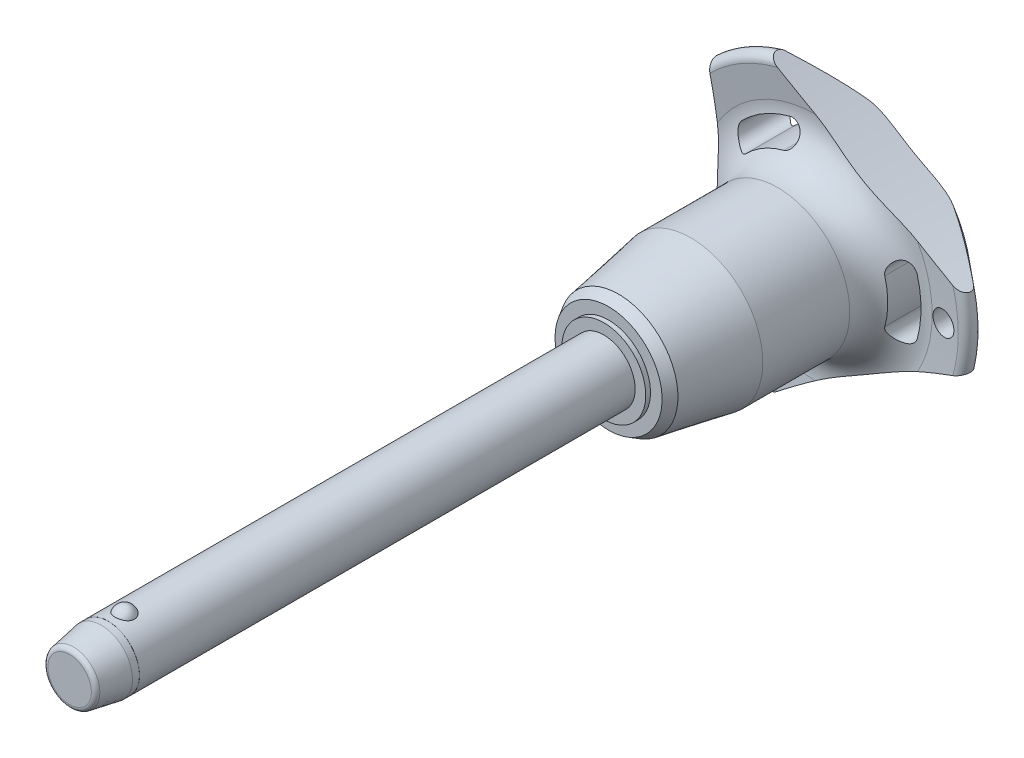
from build123d import *

# Parameters (mm, degrees)
SKETCH1_R           = 4
BOSS_EXTRUDE1_DEPTH = 60
SKETCH2_R           = 3.4
BOSS_EXTRUDE2_DEPTH = 33.3
BOSS_EXTRUDE3_START = 8.2
SKETCH1_2_R         = 4
BOSS_EXTRUDE3_DEPTH = 8.2
CHAMFER1_SIZE       = 4.1
CHAMFER1_SIZE2      = 0.722940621
FILLET1_R           = 0.6
SKETCH6_R           = 102.8
CUT_EXTRUDE1_DEPTH  = 98.333870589
CIRPATTERN1_COUNT   = 3
SKETCH7_R           = 1.5
CUT_EXTRUDE2_DEPTH  = 98.167560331
SKETCH8_R           = 4
SKETCH8_R_2         = 3.99
CUT_EXTRUDE3_DEPTH  = 4.92


with BuildPart() as part:
    # Sketch1 → Boss-Extrude1 (new body)
    with BuildSketch(Plane.XY):
        Circle(SKETCH1_R)
    extrude(amount=-BOSS_EXTRUDE1_DEPTH)

    # Sketch2 → Boss-Extrude2 (add)
    with BuildSketch(Plane(origin=(0, 0, -60), x_dir=(-1, 0, 0), z_dir=(0, 0, -1))):
        Circle(SKETCH2_R)
    extrude(amount=BOSS_EXTRUDE2_DEPTH)

    # Sketch3 → Revolve1 (revolve)
    with BuildSketch(Plane(origin=(0, 0, 0), x_dir=(0, 0, -1), z_dir=(1, 0, 0))):
        with BuildLine():
            Line((-1.2, 4.8), (-1.2, 2.2))
            ThreePointArc((-1.2, 2.2), (0.1, 3.5), (-1.2, 4.8))
        make_face()
        with BuildLine():
            Line((-1.2, -2.2), (-1.2, -4.8))
            ThreePointArc((-1.2, -4.8), (0.1, -3.5), (-1.2, -2.2))
        make_face()
    revolve(axis=Axis((0, -2.2, 1.2), (0, 1, 0)))

    # Sketch1_2 → Boss-Extrude3 (add)
    with BuildSketch(Plane.XY.offset(BOSS_EXTRUDE3_START)):
        Circle(SKETCH1_2_R)
    extrude(amount=-BOSS_EXTRUDE3_DEPTH)

    # Chamfer1
    chamfer1_edges = [part.edges().sort_by_distance(p)[0] for p in [
        (-4, 0, 8.2),
    ]]
    chamfer1_side = [part.faces().sort_by_distance(p)[0] for p in [
        (-4, 0, -25.9),
    ]]
    chamfer(chamfer1_edges, length=CHAMFER1_SIZE, length2=CHAMFER1_SIZE2, reference=chamfer1_side[0])

    # Fillet1
    fillet1_edges = [part.edges().sort_by_distance(p)[0] for p in [
        (-3.277059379, 0, 8.2),
        (3.4, 0, -93.3),
    ]]
    fillet(fillet1_edges, radius=FILLET1_R)

    # Sketch4 → Revolve2 (revolve)
    with BuildSketch(Plane(origin=(0, 0, 0), x_dir=(0, 0, -1), z_dir=(1, 0, 0)), mode=Mode.PRIVATE) as revolve2_sk:
        Polygon((60, 0), (60, 5.353660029), (60.6, 5.353660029), (60.6, 6.834334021), (61.882301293, 7.574671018), (71.1, 9.2), (82.2, 9.2), (82.2, 0), align=None)
    revolve(revolve2_sk.sketch.rotate(Axis((0, 0, -82.2), (0, 0, 1)), 90), axis=Axis((0, 0, -82.2), (0, 0, 1)))

    # Sketch5 → Revolve3 (revolve)
    with BuildSketch(Plane(origin=(0, 0, 0), x_dir=(0, 0, -1), z_dir=(1, 0, 0)), mode=Mode.PRIVATE) as revolve3_sk:
        with BuildLine():
            Line((87.169704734, 14.749576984), (86.756059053, 18.490084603))
            ThreePointArc((86.756059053, 18.490084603), (87.35677658, 19.519442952), (88.516044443, 19.24278761))
            Line((88.516044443, 19.24278761), (92.835691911, 14.094832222))
            ThreePointArc((92.835691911, 14.094832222), (93.3, 12.689260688), (92.67067517, 11.349423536))
            ThreePointArc((92.67067517, 11.349423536), (89.033110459, 6.185112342), (87.75, 0))
            Line((87.75, 0), (82.2, 0))
            Line((82.2, 0), (82.2, 9.2))
            ThreePointArc((82.2, 9.2), (85.924774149, 10.864425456), (87.169704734, 14.749576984))
        make_face()
    revolve(revolve3_sk.sketch.rotate(Axis((0, 0, -87.75), (0, 0, 1)), 90), axis=Axis((0, 0, -87.75), (0, 0, 1)))

    # Sketch6 → Cut-Extrude1 (cut, through all)
    with BuildSketch(Plane.XY):
        with Locations((-115.2, 0)):
            Circle(SKETCH6_R)
        with BuildLine():
            ThreePointArc((12.885043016, -3.538869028), (13.362182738, 0), (12.885043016, 3.538869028))
            ThreePointArc((12.885043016, 3.538869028), (11.179749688, 4.509281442), (10.209337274, 2.803988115))
            ThreePointArc((10.209337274, 2.803988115), (10.587394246, 0), (10.209337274, -2.803988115))
            ThreePointArc((10.209337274, -2.803988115), (11.179749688, -4.509281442), (12.885043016, -3.538869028))
        make_face()
    cut_extrude1 = extrude(amount=-CUT_EXTRUDE1_DEPTH, mode=Mode.SUBTRACT)

    # CirPattern1: Cut-Extrude1 ×3 about axis
    cirpattern1_axis = Axis((0, 0, 0), (0, 0, 1))
    for i in range(1, CIRPATTERN1_COUNT):
        add(cut_extrude1.rotate(cirpattern1_axis, i * 360 / CIRPATTERN1_COUNT), mode=Mode.SUBTRACT)

    # Sketch7 → Cut-Extrude2 (cut, through all)
    with BuildSketch(Plane.XY):
        with Locations(Location((16.362182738, 0, 0), (0, 0, 225.449470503))):
            Circle(SKETCH7_R)
    extrude(amount=-CUT_EXTRUDE2_DEPTH, mode=Mode.SUBTRACT)

    # Sketch8 → Cut-Extrude3 (cut)
    with BuildSketch(Plane.XY.offset(8.2)):
        Circle(SKETCH8_R)
        Circle(SKETCH8_R_2, mode=Mode.SUBTRACT)
    extrude(amount=-CUT_EXTRUDE3_DEPTH, mode=Mode.SUBTRACT)


solid = part.part
